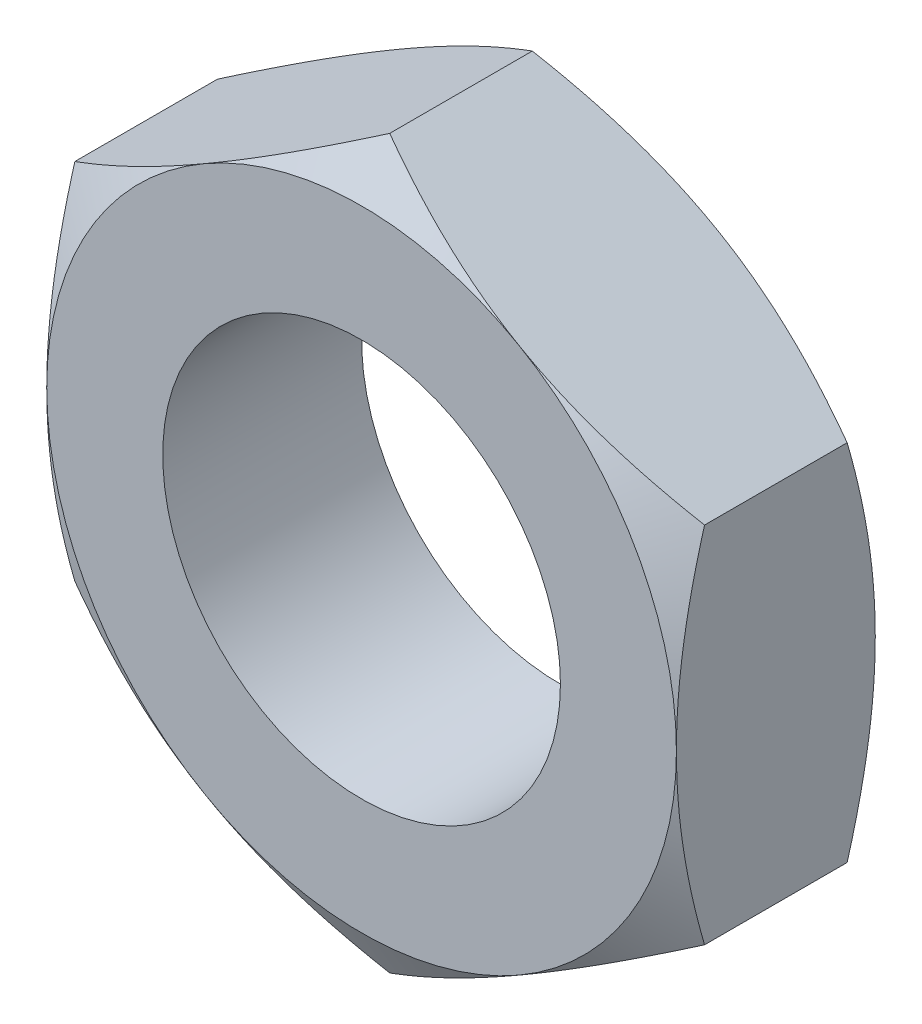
ISO-10303-21;
HEADER;
FILE_DESCRIPTION(('STEP AP214'),'2;1');
FILE_NAME('part.step','',(''),(''),'','','');
FILE_SCHEMA(('AUTOMOTIVE_DESIGN { 1 0 10303 214 1 1 1 1 }'));
ENDSEC;
DATA;
#1=APPLICATION_CONTEXT('core data for automotive mechanical design processes');
#2=APPLICATION_PROTOCOL_DEFINITION('international standard','automotive_design',2000,#1);
#3=PRODUCT_CONTEXT('',#1,'mechanical');
#4=PRODUCT('Part','Part','',(#3));
#5=PRODUCT_RELATED_PRODUCT_CATEGORY('part','',(#4));
#6=PRODUCT_DEFINITION_FORMATION('','',#4);
#7=PRODUCT_DEFINITION_CONTEXT('part definition',#1,'design');
#8=PRODUCT_DEFINITION('design','',#6,#7);
#9=PRODUCT_DEFINITION_SHAPE('','',#8);
#10=(LENGTH_UNIT() NAMED_UNIT(*) SI_UNIT(.MILLI.,.METRE.));
#11=(NAMED_UNIT(*) PLANE_ANGLE_UNIT() SI_UNIT($,.RADIAN.));
#12=(NAMED_UNIT(*) SI_UNIT($,.STERADIAN.) SOLID_ANGLE_UNIT());
#13=UNCERTAINTY_MEASURE_WITH_UNIT(LENGTH_MEASURE(1.E-05),#10,'distance_accuracy_value','');
#14=(GEOMETRIC_REPRESENTATION_CONTEXT(3) GLOBAL_UNCERTAINTY_ASSIGNED_CONTEXT((#13)) GLOBAL_UNIT_ASSIGNED_CONTEXT((#10,
#11,#12)) REPRESENTATION_CONTEXT('',''));
#15=CARTESIAN_POINT('',(0.,0.,0.));
#16=DIRECTION('',(0.,0.,1.));
#17=DIRECTION('',(1.,0.,0.));
#18=AXIS2_PLACEMENT_3D('',#15,#16,#17);
#19=CARTESIAN_POINT('',(-9.5,16.4544826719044,6.));
#20=DIRECTION('',(0.,0.,1.));
#21=DIRECTION('',(1.,0.,0.));
#22=AXIS2_PLACEMENT_3D('',#19,#20,#21);
#23=PLANE('',#22);
#24=CARTESIAN_POINT('',(0.,0.,6.));
#25=DIRECTION('',(0.,0.,-1.));
#26=DIRECTION('',(-1.,0.,0.));
#27=AXIS2_PLACEMENT_3D('',#24,#25,#26);
#28=CIRCLE('',#27,9.5);
#29=CARTESIAN_POINT('',(9.5,0.,6.));
#30=VERTEX_POINT('',#29);
#31=CARTESIAN_POINT('',(4.75,-8.22724133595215,6.));
#32=VERTEX_POINT('',#31);
#33=EDGE_CURVE('E121',#30,#32,#28,.T.);
#34=ORIENTED_EDGE('',*,*,#33,.F.);
#35=CARTESIAN_POINT('',(4.75,8.22724133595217,6.));
#36=VERTEX_POINT('',#35);
#37=EDGE_CURVE('E111',#36,#30,#28,.T.);
#38=ORIENTED_EDGE('',*,*,#37,.F.);
#39=CARTESIAN_POINT('',(-4.75,8.22724133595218,6.));
#40=VERTEX_POINT('',#39);
#41=EDGE_CURVE('E120',#40,#36,#28,.T.);
#42=ORIENTED_EDGE('',*,*,#41,.F.);
#43=CARTESIAN_POINT('',(-9.5,0.,6.));
#44=VERTEX_POINT('',#43);
#45=EDGE_CURVE('E36',#44,#40,#28,.T.);
#46=ORIENTED_EDGE('',*,*,#45,.F.);
#47=CARTESIAN_POINT('',(-4.75,-8.22724133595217,6.));
#48=VERTEX_POINT('',#47);
#49=EDGE_CURVE('E44',#48,#44,#28,.T.);
#50=ORIENTED_EDGE('',*,*,#49,.F.);
#51=EDGE_CURVE('E138',#32,#48,#28,.T.);
#52=ORIENTED_EDGE('',*,*,#51,.F.);
#53=EDGE_LOOP('',(#34,#38,#42,#46,#50,#52));
#54=FACE_BOUND('',#53,.T.);
#55=CARTESIAN_POINT('',(0.,0.,6.));
#56=DIRECTION('',(0.,0.,1.));
#57=DIRECTION('',(1.,0.,0.));
#58=AXIS2_PLACEMENT_3D('',#55,#56,#57);
#59=CIRCLE('',#58,6.);
#60=CARTESIAN_POINT('',(6.,0.,6.));
#61=VERTEX_POINT('',#60);
#62=EDGE_CURVE('E222',#61,#61,#59,.T.);
#63=ORIENTED_EDGE('',*,*,#62,.F.);
#64=EDGE_LOOP('',(#63));
#65=FACE_BOUND('',#64,.T.);
#66=ADVANCED_FACE('F14',(#54,#65),#23,.T.);
#67=CARTESIAN_POINT('',(-9.5,16.4544826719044,0.));
#68=DIRECTION('',(0.,0.,1.));
#69=DIRECTION('',(1.,0.,0.));
#70=AXIS2_PLACEMENT_3D('',#67,#68,#69);
#71=PLANE('',#70);
#72=CARTESIAN_POINT('',(0.,0.,0.));
#73=DIRECTION('',(0.,0.,-1.));
#74=DIRECTION('',(-1.,0.,0.));
#75=AXIS2_PLACEMENT_3D('',#72,#73,#74);
#76=CIRCLE('',#75,9.5);
#77=CARTESIAN_POINT('',(4.75,8.22724133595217,0.));
#78=VERTEX_POINT('',#77);
#79=CARTESIAN_POINT('',(9.5,0.,0.));
#80=VERTEX_POINT('',#79);
#81=EDGE_CURVE('E294',#78,#80,#76,.T.);
#82=ORIENTED_EDGE('',*,*,#81,.T.);
#83=CARTESIAN_POINT('',(4.75,-8.22724133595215,0.));
#84=VERTEX_POINT('',#83);
#85=EDGE_CURVE('E309',#80,#84,#76,.T.);
#86=ORIENTED_EDGE('',*,*,#85,.T.);
#87=CARTESIAN_POINT('',(-4.75,-8.22724133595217,0.));
#88=VERTEX_POINT('',#87);
#89=EDGE_CURVE('E307',#84,#88,#76,.T.);
#90=ORIENTED_EDGE('',*,*,#89,.T.);
#91=CARTESIAN_POINT('',(-9.5,0.,0.));
#92=VERTEX_POINT('',#91);
#93=EDGE_CURVE('E302',#88,#92,#76,.T.);
#94=ORIENTED_EDGE('',*,*,#93,.T.);
#95=CARTESIAN_POINT('',(-4.75,8.22724133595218,0.));
#96=VERTEX_POINT('',#95);
#97=EDGE_CURVE('E293',#92,#96,#76,.T.);
#98=ORIENTED_EDGE('',*,*,#97,.T.);
#99=EDGE_CURVE('E287',#96,#78,#76,.T.);
#100=ORIENTED_EDGE('',*,*,#99,.T.);
#101=EDGE_LOOP('',(#82,#86,#90,#94,#98,#100));
#102=FACE_BOUND('',#101,.T.);
#103=CARTESIAN_POINT('',(0.,0.,0.));
#104=DIRECTION('',(0.,0.,1.));
#105=DIRECTION('',(1.,0.,0.));
#106=AXIS2_PLACEMENT_3D('',#103,#104,#105);
#107=CIRCLE('',#106,6.);
#108=CARTESIAN_POINT('',(6.,0.,0.));
#109=VERTEX_POINT('',#108);
#110=EDGE_CURVE('E225',#109,#109,#107,.T.);
#111=ORIENTED_EDGE('',*,*,#110,.T.);
#112=EDGE_LOOP('',(#111));
#113=FACE_BOUND('',#112,.T.);
#114=ADVANCED_FACE('F247',(#102,#113),#71,.F.);
#115=CARTESIAN_POINT('',(9.5,5.48482755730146,6.));
#116=DIRECTION('',(-0.5,-0.866025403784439,0.));
#117=DIRECTION('',(0.866025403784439,-0.5,0.));
#118=AXIS2_PLACEMENT_3D('',#115,#116,#117);
#119=PLANE('',#118);
#120=DIRECTION('',(0.,0.,-1.));
#121=VECTOR('',#120,1.);
#122=CARTESIAN_POINT('',(0.,10.9696551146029,6.));
#123=LINE('',#122,#121);
#124=CARTESIAN_POINT('',(0.,10.9696551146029,5.1514942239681));
#125=VERTEX_POINT('',#124);
#126=CARTESIAN_POINT('',(0.,10.9696551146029,0.848505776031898));
#127=VERTEX_POINT('',#126);
#128=EDGE_CURVE('E237',#125,#127,#123,.T.);
#129=ORIENTED_EDGE('',*,*,#128,.F.);
#130=CARTESIAN_POINT('',(-0.000200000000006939,10.9697705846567,5.15142755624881));
#131=CARTESIAN_POINT('',(0.208630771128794,10.8492020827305,5.22102656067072));
#132=CARTESIAN_POINT('',(0.418240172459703,10.7281840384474,5.28746669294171));
#133=CARTESIAN_POINT('',(0.839139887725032,10.4851774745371,5.41315271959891));
#134=CARTESIAN_POINT('',(1.05043073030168,10.3631886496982,5.47239624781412));
#135=CARTESIAN_POINT('',(1.68770779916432,9.99525656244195,5.63818542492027));
#136=CARTESIAN_POINT('',(2.11620976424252,9.74786083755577,5.7324855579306));
#137=CARTESIAN_POINT('',(2.75744333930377,9.37764446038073,5.84306129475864));
#138=CARTESIAN_POINT('',(2.96825921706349,9.25592985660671,5.87456017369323));
#139=CARTESIAN_POINT('',(3.39086703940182,9.01193711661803,5.92738179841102));
#140=CARTESIAN_POINT('',(3.60265900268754,8.88965896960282,5.94870434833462));
#141=CARTESIAN_POINT('',(4.0265962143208,8.64489870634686,5.98062697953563));
#142=CARTESIAN_POINT('',(4.23874074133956,8.52241700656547,5.99123980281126));
#143=CARTESIAN_POINT('',(4.66322575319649,8.27734047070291,6.00151746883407));
#144=CARTESIAN_POINT('',(4.87556623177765,8.15474563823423,6.00118264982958));
#145=CARTESIAN_POINT('',(5.27254199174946,7.92555157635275,5.99032663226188));
#146=CARTESIAN_POINT('',(5.45720529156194,7.81893617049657,5.98112973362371));
#147=CARTESIAN_POINT('',(5.82610000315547,7.60595470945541,5.95463460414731));
#148=CARTESIAN_POINT('',(6.01033138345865,7.4995886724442,5.93733580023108));
#149=CARTESIAN_POINT('',(6.56231167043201,7.18090270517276,5.87369551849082));
#150=CARTESIAN_POINT('',(6.92908353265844,6.96914687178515,5.81561809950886));
#151=CARTESIAN_POINT('',(7.66651782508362,6.54338898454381,5.67042398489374));
#152=CARTESIAN_POINT('',(8.03708614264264,6.32944126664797,5.58269183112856));
#153=CARTESIAN_POINT('',(8.77269671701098,5.90473630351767,5.38357626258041));
#154=CARTESIAN_POINT('',(9.137748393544,5.6939736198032,5.27223961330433));
#155=CARTESIAN_POINT('',(9.5002,5.48471208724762,5.15142755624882));
#156=B_SPLINE_CURVE_WITH_KNOTS('',3,(#130,#131,#132,#133,#134,#135,#136,#137,#138,#139,#140,
#141,#142,#143,#144,#145,#146,#147,#148,#149,#150,#151,#152,#153,#154,#155),.UNSPECIFIED.,.F.,
.F.,(4,2,2,2,2,2,2,2,2,2,2,2,4),(0.,0.752880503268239,1.50600787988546,3.01546870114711,
3.75167336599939,4.48789219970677,5.22323407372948,5.95855322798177,6.59868084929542,
7.23885375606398,8.52010929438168,9.82978009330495,11.1368800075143),.UNSPECIFIED.);
#157=EDGE_CURVE('E321',#125,#36,#156,.T.);
#158=ORIENTED_EDGE('',*,*,#157,.T.);
#159=CARTESIAN_POINT('',(9.5,5.48482755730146,5.15149422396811));
#160=VERTEX_POINT('',#159);
#161=EDGE_CURVE('E115',#36,#160,#156,.T.);
#162=ORIENTED_EDGE('',*,*,#161,.T.);
#163=DIRECTION('',(0.,0.,-1.));
#164=VECTOR('',#163,1.);
#165=CARTESIAN_POINT('',(9.5,5.48482755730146,6.));
#166=LINE('',#165,#164);
#167=CARTESIAN_POINT('',(9.5,5.48482755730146,0.84850577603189));
#168=VERTEX_POINT('',#167);
#169=EDGE_CURVE('E135',#160,#168,#166,.T.);
#170=ORIENTED_EDGE('',*,*,#169,.T.);
#171=CARTESIAN_POINT('',(9.5002,5.48471208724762,0.848572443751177));
#172=CARTESIAN_POINT('',(9.2913692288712,5.60528058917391,0.77897343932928));
#173=CARTESIAN_POINT('',(9.08175982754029,5.72629863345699,0.712533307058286));
#174=CARTESIAN_POINT('',(8.66086011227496,5.96930519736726,0.586847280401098));
#175=CARTESIAN_POINT('',(8.44956926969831,6.09129402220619,0.527603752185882));
#176=CARTESIAN_POINT('',(7.81229220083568,6.45922610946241,0.361814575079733));
#177=CARTESIAN_POINT('',(7.38379023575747,6.7066218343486,0.267514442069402));
#178=CARTESIAN_POINT('',(6.74255666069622,7.07683821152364,0.156938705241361));
#179=CARTESIAN_POINT('',(6.5317407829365,7.19855281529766,0.125439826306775));
#180=CARTESIAN_POINT('',(6.10913296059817,7.44254555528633,0.0726182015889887));
#181=CARTESIAN_POINT('',(5.89734099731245,7.56482370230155,0.0512956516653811));
#182=CARTESIAN_POINT('',(5.4734037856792,7.8095839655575,0.0193730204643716));
#183=CARTESIAN_POINT('',(5.26125925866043,7.9320656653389,0.00876019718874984));
#184=CARTESIAN_POINT('',(4.8367742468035,8.17714220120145,-0.00151746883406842));
#185=CARTESIAN_POINT('',(4.62443376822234,8.29973703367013,-0.00118264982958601));
#186=CARTESIAN_POINT('',(4.22745800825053,8.52893109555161,0.00967336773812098));
#187=CARTESIAN_POINT('',(4.04279470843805,8.6355465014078,0.0188702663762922));
#188=CARTESIAN_POINT('',(3.67389999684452,8.84852796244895,0.0453653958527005));
#189=CARTESIAN_POINT('',(3.48966861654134,8.95489399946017,0.0626641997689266));
#190=CARTESIAN_POINT('',(2.93768832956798,9.2735799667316,0.126304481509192));
#191=CARTESIAN_POINT('',(2.57091646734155,9.48533580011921,0.184381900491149));
#192=CARTESIAN_POINT('',(1.83348217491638,9.91109368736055,0.329576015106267));
#193=CARTESIAN_POINT('',(1.46291385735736,10.1250414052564,0.417308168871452));
#194=CARTESIAN_POINT('',(0.727303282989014,10.5497463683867,0.616423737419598));
#195=CARTESIAN_POINT('',(0.362251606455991,10.7605090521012,0.727760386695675));
#196=CARTESIAN_POINT('',(-0.000200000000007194,10.9697705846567,0.848572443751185));
#197=B_SPLINE_CURVE_WITH_KNOTS('',3,(#171,#172,#173,#174,#175,#176,#177,#178,#179,#180,#181,
#182,#183,#184,#185,#186,#187,#188,#189,#190,#191,#192,#193,#194,#195,#196),.UNSPECIFIED.,.F.,
.F.,(4,2,2,2,2,2,2,2,2,2,2,2,4),(0.,0.752880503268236,1.50600787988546,3.01546870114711,
3.75167336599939,4.48789219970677,5.22323407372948,5.95855322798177,6.59868084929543,
7.23885375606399,8.52010929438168,9.82978009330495,11.1368800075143),.UNSPECIFIED.);
#198=EDGE_CURVE('E221',#168,#78,#197,.T.);
#199=ORIENTED_EDGE('',*,*,#198,.T.);
#200=EDGE_CURVE('E214',#78,#127,#197,.T.);
#201=ORIENTED_EDGE('',*,*,#200,.T.);
#202=EDGE_LOOP('',(#129,#158,#162,#170,#199,#201));
#203=FACE_BOUND('',#202,.T.);
#204=ADVANCED_FACE('F16',(#203),#119,.F.);
#205=CARTESIAN_POINT('',(0.,10.9696551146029,6.));
#206=DIRECTION('',(0.5,-0.866025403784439,0.));
#207=DIRECTION('',(0.866025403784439,0.5,0.));
#208=AXIS2_PLACEMENT_3D('',#205,#206,#207);
#209=PLANE('',#208);
#210=DIRECTION('',(0.,0.,-1.));
#211=VECTOR('',#210,1.);
#212=CARTESIAN_POINT('',(-9.5,5.48482755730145,6.));
#213=LINE('',#212,#211);
#214=CARTESIAN_POINT('',(-9.5,5.48482755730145,5.1514942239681));
#215=VERTEX_POINT('',#214);
#216=CARTESIAN_POINT('',(-9.5,5.48482755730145,0.848505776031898));
#217=VERTEX_POINT('',#216);
#218=EDGE_CURVE('E235',#215,#217,#213,.T.);
#219=ORIENTED_EDGE('',*,*,#218,.F.);
#220=CARTESIAN_POINT('',(-9.5002,5.48471208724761,5.15142755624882));
#221=CARTESIAN_POINT('',(-9.2913692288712,5.60528058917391,5.22102656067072));
#222=CARTESIAN_POINT('',(-9.0817598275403,5.72629863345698,5.28746669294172));
#223=CARTESIAN_POINT('',(-8.66086011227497,5.96930519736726,5.41315271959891));
#224=CARTESIAN_POINT('',(-8.44956926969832,6.09129402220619,5.47239624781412));
#225=CARTESIAN_POINT('',(-7.81229220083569,6.45922610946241,5.63818542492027));
#226=CARTESIAN_POINT('',(-7.38379023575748,6.70662183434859,5.7324855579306));
#227=CARTESIAN_POINT('',(-6.74255666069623,7.07683821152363,5.84306129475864));
#228=CARTESIAN_POINT('',(-6.53174078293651,7.19855281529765,5.87456017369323));
#229=CARTESIAN_POINT('',(-6.10913296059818,7.44254555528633,5.92738179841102));
#230=CARTESIAN_POINT('',(-5.89734099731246,7.56482370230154,5.94870434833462));
#231=CARTESIAN_POINT('',(-5.47340378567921,7.8095839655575,5.98062697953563));
#232=CARTESIAN_POINT('',(-5.26125925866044,7.93206566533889,5.99123980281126));
#233=CARTESIAN_POINT('',(-4.83677424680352,8.17714220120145,6.00151746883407));
#234=CARTESIAN_POINT('',(-4.62443376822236,8.29973703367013,6.00118264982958));
#235=CARTESIAN_POINT('',(-4.22745800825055,8.52893109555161,5.99032663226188));
#236=CARTESIAN_POINT('',(-4.04279470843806,8.6355465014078,5.98112973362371));
#237=CARTESIAN_POINT('',(-3.67389999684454,8.84852796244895,5.95463460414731));
#238=CARTESIAN_POINT('',(-3.48966861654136,8.95489399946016,5.93733580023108));
#239=CARTESIAN_POINT('',(-2.937688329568,9.2735799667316,5.87369551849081));
#240=CARTESIAN_POINT('',(-2.57091646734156,9.48533580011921,5.81561809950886));
#241=CARTESIAN_POINT('',(-1.83348217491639,9.91109368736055,5.67042398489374));
#242=CARTESIAN_POINT('',(-1.46291385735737,10.1250414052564,5.58269183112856));
#243=CARTESIAN_POINT('',(-0.727303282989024,10.5497463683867,5.38357626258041));
#244=CARTESIAN_POINT('',(-0.362251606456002,10.7605090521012,5.27223961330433));
#245=CARTESIAN_POINT('',(0.000199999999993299,10.9697705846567,5.15142755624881));
#246=B_SPLINE_CURVE_WITH_KNOTS('',3,(#220,#221,#222,#223,#224,#225,#226,#227,#228,#229,#230,
#231,#232,#233,#234,#235,#236,#237,#238,#239,#240,#241,#242,#243,#244,#245),.UNSPECIFIED.,.F.,
.F.,(4,2,2,2,2,2,2,2,2,2,2,2,4),(0.,0.752880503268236,1.50600787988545,3.0154687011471,
3.75167336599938,4.48789219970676,5.22323407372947,5.95855322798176,6.59868084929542,
7.23885375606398,8.52010929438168,9.82978009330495,11.1368800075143),.UNSPECIFIED.);
#247=EDGE_CURVE('E182',#215,#40,#246,.T.);
#248=ORIENTED_EDGE('',*,*,#247,.T.);
#249=EDGE_CURVE('E176',#40,#125,#246,.T.);
#250=ORIENTED_EDGE('',*,*,#249,.T.);
#251=ORIENTED_EDGE('',*,*,#128,.T.);
#252=CARTESIAN_POINT('',(0.000199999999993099,10.9697705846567,0.848572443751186));
#253=CARTESIAN_POINT('',(-0.208630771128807,10.8492020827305,0.778973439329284));
#254=CARTESIAN_POINT('',(-0.418240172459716,10.7281840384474,0.712533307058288));
#255=CARTESIAN_POINT('',(-0.839139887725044,10.4851774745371,0.586847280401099));
#256=CARTESIAN_POINT('',(-1.05043073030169,10.3631886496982,0.527603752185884));
#257=CARTESIAN_POINT('',(-1.68770779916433,9.99525656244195,0.361814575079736));
#258=CARTESIAN_POINT('',(-2.11620976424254,9.74786083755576,0.267514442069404));
#259=CARTESIAN_POINT('',(-2.75744333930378,9.37764446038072,0.156938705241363));
#260=CARTESIAN_POINT('',(-2.9682592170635,9.25592985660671,0.125439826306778));
#261=CARTESIAN_POINT('',(-3.39086703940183,9.01193711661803,0.0726182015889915));
#262=CARTESIAN_POINT('',(-3.60265900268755,8.88965896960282,0.0512956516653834));
#263=CARTESIAN_POINT('',(-4.0265962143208,8.64489870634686,0.0193730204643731));
#264=CARTESIAN_POINT('',(-4.23874074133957,8.52241700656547,0.00876019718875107));
#265=CARTESIAN_POINT('',(-4.6632257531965,8.27734047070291,-0.00151746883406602));
#266=CARTESIAN_POINT('',(-4.87556623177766,8.15474563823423,-0.00118264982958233));
#267=CARTESIAN_POINT('',(-5.27254199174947,7.92555157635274,0.00967336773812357));
#268=CARTESIAN_POINT('',(-5.45720529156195,7.81893617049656,0.018870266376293));
#269=CARTESIAN_POINT('',(-5.82610000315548,7.60595470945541,0.0453653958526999));
#270=CARTESIAN_POINT('',(-6.01033138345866,7.49958867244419,0.0626641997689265));
#271=CARTESIAN_POINT('',(-6.56231167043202,7.18090270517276,0.126304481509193));
#272=CARTESIAN_POINT('',(-6.92908353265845,6.96914687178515,0.184381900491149));
#273=CARTESIAN_POINT('',(-7.66651782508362,6.54338898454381,0.329576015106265));
#274=CARTESIAN_POINT('',(-8.03708614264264,6.32944126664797,0.41730816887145));
#275=CARTESIAN_POINT('',(-8.77269671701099,5.90473630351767,0.616423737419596));
#276=CARTESIAN_POINT('',(-9.13774839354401,5.6939736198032,0.727760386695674));
#277=CARTESIAN_POINT('',(-9.5002,5.48471208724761,0.848572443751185));
#278=B_SPLINE_CURVE_WITH_KNOTS('',3,(#252,#253,#254,#255,#256,#257,#258,#259,#260,#261,#262,
#263,#264,#265,#266,#267,#268,#269,#270,#271,#272,#273,#274,#275,#276,#277),.UNSPECIFIED.,.F.,
.F.,(4,2,2,2,2,2,2,2,2,2,2,2,4),(0.,0.752880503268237,1.50600787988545,3.01546870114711,
3.75167336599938,4.48789219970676,5.22323407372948,5.95855322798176,6.59868084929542,
7.23885375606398,8.52010929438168,9.82978009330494,11.1368800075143),.UNSPECIFIED.);
#279=EDGE_CURVE('E206',#127,#96,#278,.T.);
#280=ORIENTED_EDGE('',*,*,#279,.T.);
#281=EDGE_CURVE('E198',#96,#217,#278,.T.);
#282=ORIENTED_EDGE('',*,*,#281,.T.);
#283=EDGE_LOOP('',(#219,#248,#250,#251,#280,#282));
#284=FACE_BOUND('',#283,.T.);
#285=ADVANCED_FACE('F190',(#284),#209,.F.);
#286=CARTESIAN_POINT('',(-9.5,5.48482755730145,6.));
#287=DIRECTION('',(1.,0.,0.));
#288=DIRECTION('',(0.,1.,0.));
#289=AXIS2_PLACEMENT_3D('',#286,#287,#288);
#290=PLANE('',#289);
#291=DIRECTION('',(0.,0.,-1.));
#292=VECTOR('',#291,1.);
#293=CARTESIAN_POINT('',(-9.5,-5.48482755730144,6.));
#294=LINE('',#293,#292);
#295=CARTESIAN_POINT('',(-9.5,-5.48482755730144,5.1514942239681));
#296=VERTEX_POINT('',#295);
#297=CARTESIAN_POINT('',(-9.5,-5.48482755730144,0.848505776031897));
#298=VERTEX_POINT('',#297);
#299=EDGE_CURVE('E233',#296,#298,#294,.T.);
#300=ORIENTED_EDGE('',*,*,#299,.F.);
#301=CARTESIAN_POINT('',(-9.5,-14.6458232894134,1.40596948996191));
#302=CARTESIAN_POINT('',(-9.50000000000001,-14.4387307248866,1.50627781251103));
#303=CARTESIAN_POINT('',(-9.50000000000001,-14.2313927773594,1.60607929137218));
#304=CARTESIAN_POINT('',(-9.50000000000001,-13.8161748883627,1.8045535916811));
#305=CARTESIAN_POINT('',(-9.50000000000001,-13.6082949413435,1.90322640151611));
#306=CARTESIAN_POINT('',(-9.5,-12.9837086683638,2.19740595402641));
#307=CARTESIAN_POINT('',(-9.50000000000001,-12.5661185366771,2.39104340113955));
#308=CARTESIAN_POINT('',(-9.50000000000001,-11.7257997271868,2.77320719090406));
#309=CARTESIAN_POINT('',(-9.50000000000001,-11.3030553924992,2.96169919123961));
#310=CARTESIAN_POINT('',(-9.50000000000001,-10.4541744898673,3.33085533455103));
#311=CARTESIAN_POINT('',(-9.50000000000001,-10.0280380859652,3.51151985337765));
#312=CARTESIAN_POINT('',(-9.50000000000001,-9.15826900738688,3.86845612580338));
#313=CARTESIAN_POINT('',(-9.50000000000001,-8.71450639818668,4.04441301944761));
#314=CARTESIAN_POINT('',(-9.50000000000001,-7.82175847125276,4.38279782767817));
#315=CARTESIAN_POINT('',(-9.5,-7.37277256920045,4.54522421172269));
#316=CARTESIAN_POINT('',(-9.5,-6.4697272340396,4.85221909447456));
#317=CARTESIAN_POINT('',(-9.50000000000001,-6.01568049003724,4.99682451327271));
#318=CARTESIAN_POINT('',(-9.5,-5.10109144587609,5.26348209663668));
#319=CARTESIAN_POINT('',(-9.5,-4.64055126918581,5.38554145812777));
#320=CARTESIAN_POINT('',(-9.5,-3.71518167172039,5.60053791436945));
#321=CARTESIAN_POINT('',(-9.5,-3.2503892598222,5.69362996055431));
#322=CARTESIAN_POINT('',(-9.5,-2.54903862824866,5.80747036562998));
#323=CARTESIAN_POINT('',(-9.5,-2.31454348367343,5.84111912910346));
#324=CARTESIAN_POINT('',(-9.5,-1.84441748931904,5.89915552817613));
#325=CARTESIAN_POINT('',(-9.5,-1.60878675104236,5.92354405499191));
#326=CARTESIAN_POINT('',(-9.5,-1.13974453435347,5.96227274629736));
#327=CARTESIAN_POINT('',(-9.5,-0.906343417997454,5.97673793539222));
#328=CARTESIAN_POINT('',(-9.5,-0.439138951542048,5.99579145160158));
#329=CARTESIAN_POINT('',(-9.5,-0.205335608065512,6.00037993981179));
#330=CARTESIAN_POINT('',(-9.5,0.262256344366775,5.99957083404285));
#331=CARTESIAN_POINT('',(-9.5,0.496044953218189,5.99417317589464));
#332=CARTESIAN_POINT('',(-9.5,0.963189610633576,5.97352202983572));
#333=CARTESIAN_POINT('',(-9.5,1.1965456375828,5.95826806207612));
#334=CARTESIAN_POINT('',(-9.5,1.76004979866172,5.90985252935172));
#335=CARTESIAN_POINT('',(-9.5,2.08979045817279,5.87186593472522));
#336=CARTESIAN_POINT('',(-9.5,2.74676859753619,5.77830298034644));
#337=CARTESIAN_POINT('',(-9.5,3.07400571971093,5.72272415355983));
#338=CARTESIAN_POINT('',(-9.5,3.72568449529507,5.59595407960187));
#339=CARTESIAN_POINT('',(-9.5,4.05012370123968,5.52475037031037));
#340=CARTESIAN_POINT('',(-9.5,4.69572034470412,5.3688983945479));
#341=CARTESIAN_POINT('',(-9.5,5.01687783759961,5.28425035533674));
#342=CARTESIAN_POINT('',(-9.5,5.66289592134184,5.10158538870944));
#343=CARTESIAN_POINT('',(-9.5,5.98768512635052,5.00331773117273));
#344=CARTESIAN_POINT('',(-9.5,6.63406328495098,4.79682039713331));
#345=CARTESIAN_POINT('',(-9.5,6.95565221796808,4.6885906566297));
#346=CARTESIAN_POINT('',(-9.5,7.59579186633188,4.46387076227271));
#347=CARTESIAN_POINT('',(-9.5,7.91434359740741,4.34738348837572));
#348=CARTESIAN_POINT('',(-9.5,8.54882058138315,4.10750012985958));
#349=CARTESIAN_POINT('',(-9.5,8.8647458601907,3.98410411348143));
#350=CARTESIAN_POINT('',(-9.5,9.5896299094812,3.6932954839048));
#351=CARTESIAN_POINT('',(-9.5,9.99778069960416,3.52387231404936));
#352=CARTESIAN_POINT('',(-9.5,10.8107741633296,3.17724511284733));
#353=CARTESIAN_POINT('',(-9.5,11.2156166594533,3.00004066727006));
#354=CARTESIAN_POINT('',(-9.5,12.0225826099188,2.63935280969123));
#355=CARTESIAN_POINT('',(-9.5,12.4247055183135,2.45586817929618));
#356=CARTESIAN_POINT('',(-9.5,13.2265894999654,2.08383905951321));
#357=CARTESIAN_POINT('',(-9.5,13.6263506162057,1.89529466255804));
#358=CARTESIAN_POINT('',(-9.5,14.4242833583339,1.51387250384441));
#359=CARTESIAN_POINT('',(-9.5,14.822453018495,1.32099063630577));
#360=CARTESIAN_POINT('',(-9.5,15.6171093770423,0.931787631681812));
#361=CARTESIAN_POINT('',(-9.5,16.013596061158,0.73546646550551));
#362=CARTESIAN_POINT('',(-9.5,17.20082699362,0.142275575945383));
#363=CARTESIAN_POINT('',(-9.5,17.9894362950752,-0.258866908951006));
#364=CARTESIAN_POINT('',(-9.5,19.4998796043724,-1.03700840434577));
#365=CARTESIAN_POINT('',(-9.49999999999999,20.2220337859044,-1.41338862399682));
#366=CARTESIAN_POINT('',(-9.49999999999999,21.663629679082,-2.17135830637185));
#367=CARTESIAN_POINT('',(-9.49999999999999,22.3830713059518,-2.55294793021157));
#368=CARTESIAN_POINT('',(-9.49999999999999,23.818175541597,-3.31923699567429));
#369=CARTESIAN_POINT('',(-9.49999999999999,24.533843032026,-3.70392730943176));
#370=CARTESIAN_POINT('',(-9.49999999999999,25.9634306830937,-4.47645584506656));
#371=CARTESIAN_POINT('',(-9.49999999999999,26.6773509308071,-4.86429390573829));
#372=CARTESIAN_POINT('',(-9.5,27.3906219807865,-5.25331424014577));
#373=B_SPLINE_CURVE_WITH_KNOTS('',3,(#301,#302,#303,#304,#305,#306,#307,#308,#309,#310,#311,
#312,#313,#314,#315,#316,#317,#318,#319,#320,#321,#322,#323,#324,#325,#326,#327,#328,#329,#330,
#331,#332,#333,#334,#335,#336,#337,#338,#339,#340,#341,#342,#343,#344,#345,#346,#347,#348,#349,
#350,#351,#352,#353,#354,#355,#356,#357,#358,#359,#360,#361,#362,#363,#364,#365,#366,#367,#368,
#369,#370,#371,#372),.UNSPECIFIED.,.F.,.F.,(4,2,2,2,2,2,2,2,2,2,2,2,2,2,2,2,2,2,2,2,2,2,2,2,2,2,
2,2,2,2,2,2,2,2,2,4),(0.,0.690318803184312,1.38064470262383,2.7615053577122,4.15003191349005,
5.53849172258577,6.9704431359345,8.40255630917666,9.83165080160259,11.2602883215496,
12.6811469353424,13.3916839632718,14.102152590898,14.8034969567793,15.5048298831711,
16.2061673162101,16.9075388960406,17.902750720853,18.8981021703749,19.8942503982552,
20.8903817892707,21.9081791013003,22.9259829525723,23.943433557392,24.9608741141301,
26.2865199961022,27.6122365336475,28.9382117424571,30.2641627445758,31.5914266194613,
32.9187017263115,35.5729383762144,38.0159707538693,40.4590788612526,42.8965895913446,
45.3339762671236),.UNSPECIFIED.);
#374=EDGE_CURVE('E308',#296,#44,#373,.T.);
#375=ORIENTED_EDGE('',*,*,#374,.T.);
#376=EDGE_CURVE('E183',#44,#215,#373,.T.);
#377=ORIENTED_EDGE('',*,*,#376,.T.);
#378=ORIENTED_EDGE('',*,*,#218,.T.);
#379=CARTESIAN_POINT('',(-9.5,-14.6458232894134,4.59403051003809));
#380=CARTESIAN_POINT('',(-9.50000000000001,-14.4387307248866,4.49372218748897));
#381=CARTESIAN_POINT('',(-9.50000000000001,-14.2313927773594,4.39392070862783));
#382=CARTESIAN_POINT('',(-9.50000000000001,-13.8161748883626,4.1954464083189));
#383=CARTESIAN_POINT('',(-9.50000000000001,-13.6082949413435,4.0967735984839));
#384=CARTESIAN_POINT('',(-9.5,-12.9837086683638,3.80259404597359));
#385=CARTESIAN_POINT('',(-9.50000000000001,-12.5661185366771,3.60895659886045));
#386=CARTESIAN_POINT('',(-9.50000000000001,-11.7257997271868,3.22679280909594));
#387=CARTESIAN_POINT('',(-9.50000000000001,-11.3030553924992,3.0383008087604));
#388=CARTESIAN_POINT('',(-9.50000000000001,-10.4541744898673,2.66914466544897));
#389=CARTESIAN_POINT('',(-9.50000000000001,-10.0280380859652,2.48848014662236));
#390=CARTESIAN_POINT('',(-9.50000000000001,-9.15826900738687,2.13154387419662));
#391=CARTESIAN_POINT('',(-9.50000000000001,-8.71450639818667,1.95558698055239));
#392=CARTESIAN_POINT('',(-9.50000000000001,-7.82175847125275,1.61720217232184));
#393=CARTESIAN_POINT('',(-9.5,-7.37277256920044,1.45477578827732));
#394=CARTESIAN_POINT('',(-9.5,-6.4697272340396,1.14778090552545));
#395=CARTESIAN_POINT('',(-9.50000000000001,-6.01568049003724,1.00317548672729));
#396=CARTESIAN_POINT('',(-9.5,-5.10109144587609,0.736517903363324));
#397=CARTESIAN_POINT('',(-9.5,-4.64055126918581,0.614458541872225));
#398=CARTESIAN_POINT('',(-9.5,-3.71518167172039,0.399462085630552));
#399=CARTESIAN_POINT('',(-9.5,-3.2503892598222,0.306370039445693));
#400=CARTESIAN_POINT('',(-9.5,-2.54903862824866,0.192529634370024));
#401=CARTESIAN_POINT('',(-9.5,-2.31454348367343,0.158880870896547));
#402=CARTESIAN_POINT('',(-9.5,-1.84441748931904,0.10084447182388));
#403=CARTESIAN_POINT('',(-9.5,-1.60878675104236,0.0764559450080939));
#404=CARTESIAN_POINT('',(-9.5,-1.13974453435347,0.0377272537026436));
#405=CARTESIAN_POINT('',(-9.5,-0.906343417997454,0.0232620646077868));
#406=CARTESIAN_POINT('',(-9.5,-0.439138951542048,0.00420854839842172));
#407=CARTESIAN_POINT('',(-9.5,-0.205335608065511,-0.000379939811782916));
#408=CARTESIAN_POINT('',(-9.5,0.262256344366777,0.000429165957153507));
#409=CARTESIAN_POINT('',(-9.5,0.496044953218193,0.0058268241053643));
#410=CARTESIAN_POINT('',(-9.5,0.96318961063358,0.0264779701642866));
#411=CARTESIAN_POINT('',(-9.5,1.19654563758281,0.0417319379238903));
#412=CARTESIAN_POINT('',(-9.5,1.76004979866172,0.0901474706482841));
#413=CARTESIAN_POINT('',(-9.5,2.08979045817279,0.128134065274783));
#414=CARTESIAN_POINT('',(-9.5,2.7467685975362,0.221697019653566));
#415=CARTESIAN_POINT('',(-9.5,3.07400571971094,0.277275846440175));
#416=CARTESIAN_POINT('',(-9.5,3.72568449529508,0.404045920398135));
#417=CARTESIAN_POINT('',(-9.5,4.05012370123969,0.475249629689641));
#418=CARTESIAN_POINT('',(-9.5,4.69572034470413,0.631101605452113));
#419=CARTESIAN_POINT('',(-9.5,5.01687783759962,0.715749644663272));
#420=CARTESIAN_POINT('',(-9.5,5.66289592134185,0.898414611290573));
#421=CARTESIAN_POINT('',(-9.5,5.98768512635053,0.996682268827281));
#422=CARTESIAN_POINT('',(-9.5,6.63406328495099,1.20317960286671));
#423=CARTESIAN_POINT('',(-9.5,6.95565221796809,1.31140934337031));
#424=CARTESIAN_POINT('',(-9.5,7.59579186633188,1.5361292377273));
#425=CARTESIAN_POINT('',(-9.5,7.91434359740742,1.65261651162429));
#426=CARTESIAN_POINT('',(-9.5,8.54882058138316,1.89249987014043));
#427=CARTESIAN_POINT('',(-9.5,8.86474586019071,2.01589588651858));
#428=CARTESIAN_POINT('',(-9.5,9.58962990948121,2.30670451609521));
#429=CARTESIAN_POINT('',(-9.5,9.99778069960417,2.47612768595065));
#430=CARTESIAN_POINT('',(-9.5,10.8107741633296,2.82275488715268));
#431=CARTESIAN_POINT('',(-9.5,11.2156166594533,2.99995933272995));
#432=CARTESIAN_POINT('',(-9.5,12.0225826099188,3.36064719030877));
#433=CARTESIAN_POINT('',(-9.5,12.4247055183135,3.54413182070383));
#434=CARTESIAN_POINT('',(-9.5,13.2265894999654,3.9161609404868));
#435=CARTESIAN_POINT('',(-9.5,13.6263506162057,4.10470533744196));
#436=CARTESIAN_POINT('',(-9.5,14.4242833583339,4.48612749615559));
#437=CARTESIAN_POINT('',(-9.5,14.822453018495,4.67900936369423));
#438=CARTESIAN_POINT('',(-9.5,15.6171093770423,5.06821236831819));
#439=CARTESIAN_POINT('',(-9.5,16.013596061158,5.26453353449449));
#440=CARTESIAN_POINT('',(-9.5,17.2008269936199,5.85772442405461));
#441=CARTESIAN_POINT('',(-9.5,17.9894362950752,6.258866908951));
#442=CARTESIAN_POINT('',(-9.5,19.4998796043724,7.03700840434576));
#443=CARTESIAN_POINT('',(-9.49999999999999,20.2220337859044,7.41338862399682));
#444=CARTESIAN_POINT('',(-9.49999999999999,21.663629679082,8.17135830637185));
#445=CARTESIAN_POINT('',(-9.49999999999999,22.3830713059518,8.55294793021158));
#446=CARTESIAN_POINT('',(-9.49999999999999,23.818175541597,9.31923699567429));
#447=CARTESIAN_POINT('',(-9.49999999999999,24.5338430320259,9.70392730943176));
#448=CARTESIAN_POINT('',(-9.49999999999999,25.9634306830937,10.4764558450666));
#449=CARTESIAN_POINT('',(-9.49999999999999,26.6773509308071,10.8642939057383));
#450=CARTESIAN_POINT('',(-9.5,27.3906219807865,11.2533142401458));
#451=B_SPLINE_CURVE_WITH_KNOTS('',3,(#379,#380,#381,#382,#383,#384,#385,#386,#387,#388,#389,
#390,#391,#392,#393,#394,#395,#396,#397,#398,#399,#400,#401,#402,#403,#404,#405,#406,#407,#408,
#409,#410,#411,#412,#413,#414,#415,#416,#417,#418,#419,#420,#421,#422,#423,#424,#425,#426,#427,
#428,#429,#430,#431,#432,#433,#434,#435,#436,#437,#438,#439,#440,#441,#442,#443,#444,#445,#446,
#447,#448,#449,#450),.UNSPECIFIED.,.F.,.F.,(4,2,2,2,2,2,2,2,2,2,2,2,2,2,2,2,2,2,2,2,2,2,2,2,2,2,
2,2,2,2,2,2,2,2,2,4),(0.,0.690318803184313,1.38064470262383,2.7615053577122,4.15003191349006,
5.53849172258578,6.97044313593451,8.40255630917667,9.8316508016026,11.2602883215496,
12.6811469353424,13.3916839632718,14.102152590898,14.8034969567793,15.5048298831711,
16.2061673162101,16.9075388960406,17.902750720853,18.8981021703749,19.8942503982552,
20.8903817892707,21.9081791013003,22.9259829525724,23.943433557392,24.9608741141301,
26.2865199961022,27.6122365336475,28.9382117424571,30.2641627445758,31.5914266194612,
32.9187017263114,35.5729383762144,38.0159707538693,40.4590788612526,42.8965895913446,
45.3339762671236),.UNSPECIFIED.);
#452=EDGE_CURVE('E207',#217,#92,#451,.F.);
#453=ORIENTED_EDGE('',*,*,#452,.T.);
#454=EDGE_CURVE('E208',#92,#298,#451,.F.);
#455=ORIENTED_EDGE('',*,*,#454,.T.);
#456=EDGE_LOOP('',(#300,#375,#377,#378,#453,#455));
#457=FACE_BOUND('',#456,.T.);
#458=ADVANCED_FACE('F193',(#457),#290,.F.);
#459=CARTESIAN_POINT('',(-9.5,-5.48482755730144,6.));
#460=DIRECTION('',(0.5,0.866025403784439,0.));
#461=DIRECTION('',(-0.866025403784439,0.5,0.));
#462=AXIS2_PLACEMENT_3D('',#459,#460,#461);
#463=PLANE('',#462);
#464=DIRECTION('',(0.,0.,-1.));
#465=VECTOR('',#464,1.);
#466=CARTESIAN_POINT('',(0.,-10.9696551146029,6.));
#467=LINE('',#466,#465);
#468=CARTESIAN_POINT('',(0.,-10.9696551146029,5.15149422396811));
#469=VERTEX_POINT('',#468);
#470=CARTESIAN_POINT('',(0.,-10.9696551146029,0.848505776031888));
#471=VERTEX_POINT('',#470);
#472=EDGE_CURVE('E231',#469,#471,#467,.T.);
#473=ORIENTED_EDGE('',*,*,#472,.F.);
#474=CARTESIAN_POINT('',(0.000199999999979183,-10.9697705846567,5.15142755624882));
#475=CARTESIAN_POINT('',(-0.208630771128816,-10.8492020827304,5.22102656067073));
#476=CARTESIAN_POINT('',(-0.418240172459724,-10.7281840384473,5.28746669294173));
#477=CARTESIAN_POINT('',(-0.839139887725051,-10.4851774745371,5.41315271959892));
#478=CARTESIAN_POINT('',(-1.0504307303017,-10.3631886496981,5.47239624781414));
#479=CARTESIAN_POINT('',(-1.68770779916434,-9.99525656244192,5.63818542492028));
#480=CARTESIAN_POINT('',(-2.11620976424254,-9.74786083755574,5.73248555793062));
#481=CARTESIAN_POINT('',(-2.75744333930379,-9.3776444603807,5.84306129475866));
#482=CARTESIAN_POINT('',(-2.96825921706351,-9.25592985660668,5.87456017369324));
#483=CARTESIAN_POINT('',(-3.39086703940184,-9.011937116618,5.92738179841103));
#484=CARTESIAN_POINT('',(-3.60265900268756,-8.88965896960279,5.94870434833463));
#485=CARTESIAN_POINT('',(-4.02659621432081,-8.64489870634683,5.98062697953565));
#486=CARTESIAN_POINT('',(-4.23874074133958,-8.52241700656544,5.99123980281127));
#487=CARTESIAN_POINT('',(-4.66322575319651,-8.27734047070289,6.00151746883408));
#488=CARTESIAN_POINT('',(-4.87556623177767,-8.15474563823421,6.00118264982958));
#489=CARTESIAN_POINT('',(-5.27254199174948,-7.92555157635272,5.99032663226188));
#490=CARTESIAN_POINT('',(-5.45720529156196,-7.81893617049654,5.98112973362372));
#491=CARTESIAN_POINT('',(-5.82610000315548,-7.60595470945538,5.95463460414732));
#492=CARTESIAN_POINT('',(-6.01033138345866,-7.49958867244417,5.93733580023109));
#493=CARTESIAN_POINT('',(-6.56231167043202,-7.18090270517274,5.87369551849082));
#494=CARTESIAN_POINT('',(-6.92908353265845,-6.96914687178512,5.81561809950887));
#495=CARTESIAN_POINT('',(-7.66651782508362,-6.54338898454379,5.67042398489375));
#496=CARTESIAN_POINT('',(-8.03708614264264,-6.32944126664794,5.58269183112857));
#497=CARTESIAN_POINT('',(-8.77269671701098,-5.90473630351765,5.38357626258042));
#498=CARTESIAN_POINT('',(-9.13774839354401,-5.69397361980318,5.27223961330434));
#499=CARTESIAN_POINT('',(-9.5002,-5.4847120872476,5.15142755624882));
#500=B_SPLINE_CURVE_WITH_KNOTS('',3,(#474,#475,#476,#477,#478,#479,#480,#481,#482,#483,#484,
#485,#486,#487,#488,#489,#490,#491,#492,#493,#494,#495,#496,#497,#498,#499),.UNSPECIFIED.,.F.,
.F.,(4,2,2,2,2,2,2,2,2,2,2,2,4),(0.,0.752880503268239,1.50600787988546,3.01546870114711,
3.75167336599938,4.48789219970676,5.22323407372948,5.95855322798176,6.59868084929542,
7.23885375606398,8.52010929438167,9.82978009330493,11.1368800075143),.UNSPECIFIED.);
#501=EDGE_CURVE('E170',#469,#48,#500,.T.);
#502=ORIENTED_EDGE('',*,*,#501,.T.);
#503=EDGE_CURVE('E314',#48,#296,#500,.T.);
#504=ORIENTED_EDGE('',*,*,#503,.T.);
#505=ORIENTED_EDGE('',*,*,#299,.T.);
#506=CARTESIAN_POINT('',(-9.5002,-5.4847120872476,0.848572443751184));
#507=CARTESIAN_POINT('',(-9.2913692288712,-5.60528058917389,0.778973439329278));
#508=CARTESIAN_POINT('',(-9.08175982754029,-5.72629863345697,0.712533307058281));
#509=CARTESIAN_POINT('',(-8.66086011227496,-5.96930519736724,0.586847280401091));
#510=CARTESIAN_POINT('',(-8.44956926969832,-6.09129402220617,0.527603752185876));
#511=CARTESIAN_POINT('',(-7.81229220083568,-6.45922610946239,0.361814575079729));
#512=CARTESIAN_POINT('',(-7.38379023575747,-6.70662183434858,0.267514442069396));
#513=CARTESIAN_POINT('',(-6.74255666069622,-7.07683821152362,0.156938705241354));
#514=CARTESIAN_POINT('',(-6.53174078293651,-7.19855281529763,0.125439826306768));
#515=CARTESIAN_POINT('',(-6.10913296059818,-7.44254555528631,0.0726182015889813));
#516=CARTESIAN_POINT('',(-5.89734099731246,-7.56482370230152,0.0512956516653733));
#517=CARTESIAN_POINT('',(-5.4734037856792,-7.80958396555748,0.0193730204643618));
#518=CARTESIAN_POINT('',(-5.26125925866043,-7.93206566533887,0.00876019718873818));
#519=CARTESIAN_POINT('',(-4.83677424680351,-8.17714220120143,-0.00151746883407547));
#520=CARTESIAN_POINT('',(-4.62443376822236,-8.29973703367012,-0.00118264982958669));
#521=CARTESIAN_POINT('',(-4.22745800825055,-8.5289310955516,0.00967336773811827));
#522=CARTESIAN_POINT('',(-4.04279470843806,-8.63554650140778,0.018870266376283));
#523=CARTESIAN_POINT('',(-3.67389999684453,-8.84852796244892,0.0453653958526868));
#524=CARTESIAN_POINT('',(-3.48966861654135,-8.95489399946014,0.062664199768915));
#525=CARTESIAN_POINT('',(-2.937688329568,-9.27357996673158,0.126304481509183));
#526=CARTESIAN_POINT('',(-2.57091646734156,-9.48533580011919,0.184381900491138));
#527=CARTESIAN_POINT('',(-1.83348217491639,-9.91109368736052,0.329576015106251));
#528=CARTESIAN_POINT('',(-1.46291385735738,-10.1250414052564,0.417308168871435));
#529=CARTESIAN_POINT('',(-0.727303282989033,-10.5497463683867,0.616423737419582));
#530=CARTESIAN_POINT('',(-0.362251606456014,-10.7605090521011,0.727760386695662));
#531=CARTESIAN_POINT('',(0.000199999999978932,-10.9697705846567,0.848572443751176));
#532=B_SPLINE_CURVE_WITH_KNOTS('',3,(#506,#507,#508,#509,#510,#511,#512,#513,#514,#515,#516,
#517,#518,#519,#520,#521,#522,#523,#524,#525,#526,#527,#528,#529,#530,#531),.UNSPECIFIED.,.F.,
.F.,(4,2,2,2,2,2,2,2,2,2,2,2,4),(0.,0.752880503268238,1.50600787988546,3.01546870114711,
3.75167336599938,4.48789219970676,5.22323407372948,5.95855322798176,6.59868084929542,
7.23885375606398,8.52010929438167,9.82978009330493,11.1368800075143),.UNSPECIFIED.);
#533=EDGE_CURVE('E336',#298,#88,#532,.T.);
#534=ORIENTED_EDGE('',*,*,#533,.T.);
#535=EDGE_CURVE('E334',#88,#471,#532,.T.);
#536=ORIENTED_EDGE('',*,*,#535,.T.);
#537=EDGE_LOOP('',(#473,#502,#504,#505,#534,#536));
#538=FACE_BOUND('',#537,.T.);
#539=ADVANCED_FACE('F338',(#538),#463,.F.);
#540=CARTESIAN_POINT('',(0.,-10.9696551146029,6.));
#541=DIRECTION('',(-0.5,0.866025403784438,0.));
#542=DIRECTION('',(-0.866025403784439,-0.5,0.));
#543=AXIS2_PLACEMENT_3D('',#540,#541,#542);
#544=PLANE('',#543);
#545=DIRECTION('',(0.,0.,-1.));
#546=VECTOR('',#545,1.);
#547=CARTESIAN_POINT('',(9.5,-5.48482755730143,6.));
#548=LINE('',#547,#546);
#549=CARTESIAN_POINT('',(9.5,-5.48482755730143,5.15149422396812));
#550=VERTEX_POINT('',#549);
#551=CARTESIAN_POINT('',(9.5,-5.48482755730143,0.848505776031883));
#552=VERTEX_POINT('',#551);
#553=EDGE_CURVE('E229',#550,#552,#548,.T.);
#554=ORIENTED_EDGE('',*,*,#553,.F.);
#555=CARTESIAN_POINT('',(9.5002,-5.48471208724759,5.15142755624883));
#556=CARTESIAN_POINT('',(9.2913692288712,-5.60528058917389,5.22102656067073));
#557=CARTESIAN_POINT('',(9.0817598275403,-5.72629863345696,5.28746669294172));
#558=CARTESIAN_POINT('',(8.66086011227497,-5.96930519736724,5.41315271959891));
#559=CARTESIAN_POINT('',(8.44956926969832,-6.09129402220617,5.47239624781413));
#560=CARTESIAN_POINT('',(7.81229220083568,-6.45922610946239,5.63818542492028));
#561=CARTESIAN_POINT('',(7.38379023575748,-6.70662183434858,5.73248555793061));
#562=CARTESIAN_POINT('',(6.74255666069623,-7.07683821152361,5.84306129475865));
#563=CARTESIAN_POINT('',(6.53174078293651,-7.19855281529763,5.87456017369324));
#564=CARTESIAN_POINT('',(6.10913296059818,-7.44254555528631,5.92738179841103));
#565=CARTESIAN_POINT('',(5.89734099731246,-7.56482370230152,5.94870434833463));
#566=CARTESIAN_POINT('',(5.47340378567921,-7.80958396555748,5.98062697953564));
#567=CARTESIAN_POINT('',(5.26125925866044,-7.93206566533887,5.99123980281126));
#568=CARTESIAN_POINT('',(4.83677424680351,-8.17714220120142,6.00151746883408));
#569=CARTESIAN_POINT('',(4.62443376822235,-8.2997370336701,6.0011826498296));
#570=CARTESIAN_POINT('',(4.22745800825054,-8.52893109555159,5.9903266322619));
#571=CARTESIAN_POINT('',(4.04279470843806,-8.63554650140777,5.98112973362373));
#572=CARTESIAN_POINT('',(3.67389999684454,-8.84852796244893,5.95463460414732));
#573=CARTESIAN_POINT('',(3.48966861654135,-8.95489399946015,5.93733580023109));
#574=CARTESIAN_POINT('',(2.93768832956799,-9.27357996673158,5.87369551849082));
#575=CARTESIAN_POINT('',(2.57091646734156,-9.48533580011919,5.81561809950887));
#576=CARTESIAN_POINT('',(1.83348217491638,-9.91109368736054,5.67042398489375));
#577=CARTESIAN_POINT('',(1.46291385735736,-10.1250414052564,5.58269183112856));
#578=CARTESIAN_POINT('',(0.727303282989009,-10.5497463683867,5.38357626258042));
#579=CARTESIAN_POINT('',(0.362251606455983,-10.7605090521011,5.27223961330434));
#580=CARTESIAN_POINT('',(-0.000200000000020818,-10.9697705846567,5.15142755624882));
#581=B_SPLINE_CURVE_WITH_KNOTS('',3,(#555,#556,#557,#558,#559,#560,#561,#562,#563,#564,#565,
#566,#567,#568,#569,#570,#571,#572,#573,#574,#575,#576,#577,#578,#579,#580),.UNSPECIFIED.,.F.,
.F.,(4,2,2,2,2,2,2,2,2,2,2,2,4),(0.,0.752880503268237,1.50600787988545,3.01546870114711,
3.75167336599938,4.48789219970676,5.22323407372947,5.95855322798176,6.59868084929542,
7.23885375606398,8.52010929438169,9.82978009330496,11.1368800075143),.UNSPECIFIED.);
#582=EDGE_CURVE('E128',#550,#32,#581,.T.);
#583=ORIENTED_EDGE('',*,*,#582,.T.);
#584=EDGE_CURVE('E146',#32,#469,#581,.T.);
#585=ORIENTED_EDGE('',*,*,#584,.T.);
#586=ORIENTED_EDGE('',*,*,#472,.T.);
#587=CARTESIAN_POINT('',(-0.000200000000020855,-10.9697705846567,0.848572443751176));
#588=CARTESIAN_POINT('',(0.208630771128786,-10.8492020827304,0.778973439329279));
#589=CARTESIAN_POINT('',(0.418240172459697,-10.7281840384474,0.712533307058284));
#590=CARTESIAN_POINT('',(0.839139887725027,-10.4851774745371,0.586847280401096));
#591=CARTESIAN_POINT('',(1.05043073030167,-10.3631886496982,0.52760375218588));
#592=CARTESIAN_POINT('',(1.68770779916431,-9.99525656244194,0.36181457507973));
#593=CARTESIAN_POINT('',(2.11620976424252,-9.74786083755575,0.267514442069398));
#594=CARTESIAN_POINT('',(2.75744333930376,-9.37764446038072,0.156938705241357));
#595=CARTESIAN_POINT('',(2.96825921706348,-9.2559298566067,0.125439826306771));
#596=CARTESIAN_POINT('',(3.39086703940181,-9.01193711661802,0.0726182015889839));
#597=CARTESIAN_POINT('',(3.60265900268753,-8.88965896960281,0.051295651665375));
#598=CARTESIAN_POINT('',(4.02659621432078,-8.64489870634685,0.019373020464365));
#599=CARTESIAN_POINT('',(4.23874074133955,-8.52241700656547,0.00876019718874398));
#600=CARTESIAN_POINT('',(4.66322575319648,-8.2773404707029,-0.0015174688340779));
#601=CARTESIAN_POINT('',(4.87556623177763,-8.15474563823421,-0.00118264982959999));
#602=CARTESIAN_POINT('',(5.27254199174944,-7.92555157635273,0.00967336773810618));
#603=CARTESIAN_POINT('',(5.45720529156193,-7.81893617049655,0.0188702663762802));
#604=CARTESIAN_POINT('',(5.82610000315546,-7.60595470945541,0.045365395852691));
#605=CARTESIAN_POINT('',(6.01033138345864,-7.49958867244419,0.0626641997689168));
#606=CARTESIAN_POINT('',(6.562311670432,-7.18090270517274,0.126304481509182));
#607=CARTESIAN_POINT('',(6.92908353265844,-6.96914687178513,0.184381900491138));
#608=CARTESIAN_POINT('',(7.66651782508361,-6.5433889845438,0.329576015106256));
#609=CARTESIAN_POINT('',(8.03708614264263,-6.32944126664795,0.417308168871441));
#610=CARTESIAN_POINT('',(8.77269671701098,-5.90473630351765,0.616423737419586));
#611=CARTESIAN_POINT('',(9.137748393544,-5.69397361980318,0.727760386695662));
#612=CARTESIAN_POINT('',(9.5002,-5.48471208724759,0.848572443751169));
#613=B_SPLINE_CURVE_WITH_KNOTS('',3,(#587,#588,#589,#590,#591,#592,#593,#594,#595,#596,#597,
#598,#599,#600,#601,#602,#603,#604,#605,#606,#607,#608,#609,#610,#611,#612),.UNSPECIFIED.,.F.,
.F.,(4,2,2,2,2,2,2,2,2,2,2,2,4),(0.,0.752880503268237,1.50600787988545,3.0154687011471,
3.75167336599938,4.48789219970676,5.22323407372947,5.95855322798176,6.59868084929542,
7.23885375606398,8.52010929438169,9.82978009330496,11.1368800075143),.UNSPECIFIED.);
#614=EDGE_CURVE('E305',#471,#84,#613,.T.);
#615=ORIENTED_EDGE('',*,*,#614,.T.);
#616=EDGE_CURVE('E303',#84,#552,#613,.T.);
#617=ORIENTED_EDGE('',*,*,#616,.T.);
#618=EDGE_LOOP('',(#554,#583,#585,#586,#615,#617));
#619=FACE_BOUND('',#618,.T.);
#620=ADVANCED_FACE('F152',(#619),#544,.F.);
#621=CARTESIAN_POINT('',(9.5,-5.48482755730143,6.));
#622=DIRECTION('',(-1.,0.,0.));
#623=DIRECTION('',(0.,-1.,0.));
#624=AXIS2_PLACEMENT_3D('',#621,#622,#623);
#625=PLANE('',#624);
#626=ORIENTED_EDGE('',*,*,#169,.F.);
#627=CARTESIAN_POINT('',(9.5,-14.6458232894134,1.40596948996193));
#628=CARTESIAN_POINT('',(9.5,-14.4387307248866,1.50627781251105));
#629=CARTESIAN_POINT('',(9.5,-14.2313927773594,1.60607929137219));
#630=CARTESIAN_POINT('',(9.5,-13.8161748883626,1.80455359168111));
#631=CARTESIAN_POINT('',(9.5,-13.6082949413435,1.90322640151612));
#632=CARTESIAN_POINT('',(9.5,-12.9837086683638,2.19740595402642));
#633=CARTESIAN_POINT('',(9.5,-12.5661185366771,2.39104340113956));
#634=CARTESIAN_POINT('',(9.5,-11.7257997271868,2.77320719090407));
#635=CARTESIAN_POINT('',(9.5,-11.3030553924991,2.96169919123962));
#636=CARTESIAN_POINT('',(9.5,-10.4541744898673,3.33085533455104));
#637=CARTESIAN_POINT('',(9.5,-10.0280380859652,3.51151985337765));
#638=CARTESIAN_POINT('',(9.5,-9.15826900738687,3.86845612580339));
#639=CARTESIAN_POINT('',(9.5,-8.71450639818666,4.04441301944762));
#640=CARTESIAN_POINT('',(9.5,-7.82175847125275,4.38279782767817));
#641=CARTESIAN_POINT('',(9.5,-7.37277256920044,4.54522421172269));
#642=CARTESIAN_POINT('',(9.5,-6.46972723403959,4.85221909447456));
#643=CARTESIAN_POINT('',(9.5,-6.01568049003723,4.99682451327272));
#644=CARTESIAN_POINT('',(9.5,-5.10109144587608,5.26348209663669));
#645=CARTESIAN_POINT('',(9.5,-4.64055126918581,5.38554145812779));
#646=CARTESIAN_POINT('',(9.5,-3.71518167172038,5.60053791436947));
#647=CARTESIAN_POINT('',(9.5,-3.2503892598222,5.69362996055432));
#648=CARTESIAN_POINT('',(9.5,-2.54903862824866,5.80747036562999));
#649=CARTESIAN_POINT('',(9.5,-2.31454348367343,5.84111912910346));
#650=CARTESIAN_POINT('',(9.5,-1.84441748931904,5.89915552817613));
#651=CARTESIAN_POINT('',(9.5,-1.60878675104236,5.92354405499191));
#652=CARTESIAN_POINT('',(9.5,-1.13974453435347,5.96227274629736));
#653=CARTESIAN_POINT('',(9.5,-0.906343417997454,5.97673793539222));
#654=CARTESIAN_POINT('',(9.5,-0.439138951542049,5.99579145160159));
#655=CARTESIAN_POINT('',(9.5,-0.205335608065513,6.00037993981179));
#656=CARTESIAN_POINT('',(9.5,0.262256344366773,5.99957083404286));
#657=CARTESIAN_POINT('',(9.5,0.496044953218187,5.99417317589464));
#658=CARTESIAN_POINT('',(9.5,0.963189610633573,5.97352202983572));
#659=CARTESIAN_POINT('',(9.5,1.1965456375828,5.95826806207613));
#660=CARTESIAN_POINT('',(9.5,1.76004979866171,5.90985252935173));
#661=CARTESIAN_POINT('',(9.5,2.08979045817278,5.87186593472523));
#662=CARTESIAN_POINT('',(9.5,2.74676859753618,5.77830298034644));
#663=CARTESIAN_POINT('',(9.5,3.07400571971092,5.72272415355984));
#664=CARTESIAN_POINT('',(9.5,3.72568449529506,5.59595407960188));
#665=CARTESIAN_POINT('',(9.5,4.05012370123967,5.52475037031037));
#666=CARTESIAN_POINT('',(9.5,4.69572034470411,5.3688983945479));
#667=CARTESIAN_POINT('',(9.5,5.0168778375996,5.28425035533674));
#668=CARTESIAN_POINT('',(9.5,5.66289592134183,5.10158538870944));
#669=CARTESIAN_POINT('',(9.5,5.9876851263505,5.00331773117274));
#670=CARTESIAN_POINT('',(9.5,6.63406328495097,4.79682039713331));
#671=CARTESIAN_POINT('',(9.5,6.95565221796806,4.68859065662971));
#672=CARTESIAN_POINT('',(9.5,7.59579186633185,4.46387076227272));
#673=CARTESIAN_POINT('',(9.49999999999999,7.91434359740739,4.34738348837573));
#674=CARTESIAN_POINT('',(9.5,8.54882058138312,4.10750012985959));
#675=CARTESIAN_POINT('',(9.5,8.86474586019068,3.98410411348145));
#676=CARTESIAN_POINT('',(9.5,9.58962990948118,3.69329548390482));
#677=CARTESIAN_POINT('',(9.5,9.99778069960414,3.52387231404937));
#678=CARTESIAN_POINT('',(9.49999999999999,10.8107741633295,3.17724511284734));
#679=CARTESIAN_POINT('',(9.49999999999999,11.2156166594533,3.00004066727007));
#680=CARTESIAN_POINT('',(9.49999999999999,12.0225826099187,2.63935280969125));
#681=CARTESIAN_POINT('',(9.49999999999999,12.4247055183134,2.45586817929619));
#682=CARTESIAN_POINT('',(9.49999999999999,13.2265894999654,2.08383905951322));
#683=CARTESIAN_POINT('',(9.49999999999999,13.6263506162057,1.89529466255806));
#684=CARTESIAN_POINT('',(9.49999999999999,14.4242833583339,1.51387250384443));
#685=CARTESIAN_POINT('',(9.49999999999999,14.822453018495,1.32099063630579));
#686=CARTESIAN_POINT('',(9.49999999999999,15.6171093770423,0.931787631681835));
#687=CARTESIAN_POINT('',(9.49999999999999,16.0135960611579,0.735466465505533));
#688=CARTESIAN_POINT('',(9.49999999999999,17.2008269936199,0.142275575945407));
#689=CARTESIAN_POINT('',(9.49999999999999,17.9894362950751,-0.258866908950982));
#690=CARTESIAN_POINT('',(9.49999999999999,19.4998796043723,-1.03700840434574));
#691=CARTESIAN_POINT('',(9.49999999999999,20.2220337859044,-1.41338862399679));
#692=CARTESIAN_POINT('',(9.49999999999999,21.6636296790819,-2.17135830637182));
#693=CARTESIAN_POINT('',(9.49999999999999,22.3830713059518,-2.55294793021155));
#694=CARTESIAN_POINT('',(9.49999999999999,23.8181755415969,-3.31923699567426));
#695=CARTESIAN_POINT('',(9.49999999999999,24.5338430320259,-3.70392730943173));
#696=CARTESIAN_POINT('',(9.49999999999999,25.9634306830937,-4.47645584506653));
#697=CARTESIAN_POINT('',(9.49999999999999,26.6773509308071,-4.86429390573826));
#698=CARTESIAN_POINT('',(9.5,27.3906219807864,-5.25331424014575));
#699=B_SPLINE_CURVE_WITH_KNOTS('',3,(#627,#628,#629,#630,#631,#632,#633,#634,#635,#636,#637,
#638,#639,#640,#641,#642,#643,#644,#645,#646,#647,#648,#649,#650,#651,#652,#653,#654,#655,#656,
#657,#658,#659,#660,#661,#662,#663,#664,#665,#666,#667,#668,#669,#670,#671,#672,#673,#674,#675,
#676,#677,#678,#679,#680,#681,#682,#683,#684,#685,#686,#687,#688,#689,#690,#691,#692,#693,#694,
#695,#696,#697,#698),.UNSPECIFIED.,.F.,.F.,(4,2,2,2,2,2,2,2,2,2,2,2,2,2,2,2,2,2,2,2,2,2,2,2,2,2,
2,2,2,2,2,2,2,2,2,4),(0.,0.69031880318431,1.38064470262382,2.7615053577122,4.15003191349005,
5.53849172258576,6.97044313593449,8.40255630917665,9.83165080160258,11.2602883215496,
12.6811469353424,13.3916839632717,14.102152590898,14.8034969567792,15.5048298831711,
16.2061673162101,16.9075388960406,17.902750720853,18.8981021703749,19.8942503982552,
20.8903817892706,21.9081791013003,22.9259829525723,23.943433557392,24.96087411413,
26.2865199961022,27.6122365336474,28.9382117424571,30.2641627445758,31.5914266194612,
32.9187017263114,35.5729383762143,38.0159707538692,40.4590788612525,42.8965895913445,
45.3339762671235),.UNSPECIFIED.);
#700=EDGE_CURVE('E9',#160,#30,#699,.F.);
#701=ORIENTED_EDGE('',*,*,#700,.T.);
#702=EDGE_CURVE('E19',#30,#550,#699,.F.);
#703=ORIENTED_EDGE('',*,*,#702,.T.);
#704=ORIENTED_EDGE('',*,*,#553,.T.);
#705=CARTESIAN_POINT('',(9.5,-14.6458232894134,4.59403051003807));
#706=CARTESIAN_POINT('',(9.5,-14.4387307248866,4.49372218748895));
#707=CARTESIAN_POINT('',(9.5,-14.2313927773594,4.39392070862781));
#708=CARTESIAN_POINT('',(9.5,-13.8161748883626,4.19544640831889));
#709=CARTESIAN_POINT('',(9.5,-13.6082949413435,4.09677359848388));
#710=CARTESIAN_POINT('',(9.5,-12.9837086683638,3.80259404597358));
#711=CARTESIAN_POINT('',(9.5,-12.566118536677,3.60895659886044));
#712=CARTESIAN_POINT('',(9.5,-11.7257997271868,3.22679280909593));
#713=CARTESIAN_POINT('',(9.5,-11.3030553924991,3.03830080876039));
#714=CARTESIAN_POINT('',(9.5,-10.4541744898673,2.66914466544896));
#715=CARTESIAN_POINT('',(9.5,-10.0280380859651,2.48848014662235));
#716=CARTESIAN_POINT('',(9.5,-9.15826900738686,2.13154387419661));
#717=CARTESIAN_POINT('',(9.5,-8.71450639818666,1.95558698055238));
#718=CARTESIAN_POINT('',(9.5,-7.82175847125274,1.61720217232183));
#719=CARTESIAN_POINT('',(9.5,-7.37277256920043,1.45477578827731));
#720=CARTESIAN_POINT('',(9.5,-6.46972723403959,1.14778090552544));
#721=CARTESIAN_POINT('',(9.5,-6.01568049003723,1.00317548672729));
#722=CARTESIAN_POINT('',(9.5,-5.10109144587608,0.736517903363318));
#723=CARTESIAN_POINT('',(9.5,-4.64055126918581,0.614458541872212));
#724=CARTESIAN_POINT('',(9.5,-3.71518167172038,0.39946208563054));
#725=CARTESIAN_POINT('',(9.5,-3.2503892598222,0.306370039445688));
#726=CARTESIAN_POINT('',(9.5,-2.54903862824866,0.192529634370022));
#727=CARTESIAN_POINT('',(9.5,-2.31454348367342,0.158880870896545));
#728=CARTESIAN_POINT('',(9.5,-1.84441748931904,0.100844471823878));
#729=CARTESIAN_POINT('',(9.5,-1.60878675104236,0.0764559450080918));
#730=CARTESIAN_POINT('',(9.5,-1.13974453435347,0.0377272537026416));
#731=CARTESIAN_POINT('',(9.5,-0.906343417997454,0.0232620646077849));
#732=CARTESIAN_POINT('',(9.5,-0.439138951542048,0.00420854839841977));
#733=CARTESIAN_POINT('',(9.5,-0.205335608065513,-0.000379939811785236));
#734=CARTESIAN_POINT('',(9.5,0.262256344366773,0.000429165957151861));
#735=CARTESIAN_POINT('',(9.5,0.496044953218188,0.00582682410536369));
#736=CARTESIAN_POINT('',(9.5,0.963189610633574,0.0264779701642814));
#737=CARTESIAN_POINT('',(9.5,1.1965456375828,0.0417319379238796));
#738=CARTESIAN_POINT('',(9.5,1.76004979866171,0.0901474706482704));
#739=CARTESIAN_POINT('',(9.5,2.08979045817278,0.128134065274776));
#740=CARTESIAN_POINT('',(9.5,2.74676859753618,0.221697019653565));
#741=CARTESIAN_POINT('',(9.5,3.07400571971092,0.277275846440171));
#742=CARTESIAN_POINT('',(9.5,3.72568449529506,0.404045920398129));
#743=CARTESIAN_POINT('',(9.5,4.05012370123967,0.475249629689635));
#744=CARTESIAN_POINT('',(9.5,4.69572034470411,0.631101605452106));
#745=CARTESIAN_POINT('',(9.5,5.01687783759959,0.715749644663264));
#746=CARTESIAN_POINT('',(9.5,5.66289592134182,0.898414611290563));
#747=CARTESIAN_POINT('',(9.5,5.9876851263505,0.99668226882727));
#748=CARTESIAN_POINT('',(9.5,6.63406328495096,1.20317960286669));
#749=CARTESIAN_POINT('',(9.5,6.95565221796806,1.31140934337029));
#750=CARTESIAN_POINT('',(9.5,7.59579186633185,1.53612923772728));
#751=CARTESIAN_POINT('',(9.49999999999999,7.91434359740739,1.65261651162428));
#752=CARTESIAN_POINT('',(9.5,8.54882058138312,1.89249987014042));
#753=CARTESIAN_POINT('',(9.5,8.86474586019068,2.01589588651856));
#754=CARTESIAN_POINT('',(9.5,9.58962990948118,2.30670451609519));
#755=CARTESIAN_POINT('',(9.5,9.99778069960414,2.47612768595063));
#756=CARTESIAN_POINT('',(9.49999999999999,10.8107741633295,2.82275488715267));
#757=CARTESIAN_POINT('',(9.49999999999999,11.2156166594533,2.99995933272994));
#758=CARTESIAN_POINT('',(9.49999999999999,12.0225826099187,3.36064719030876));
#759=CARTESIAN_POINT('',(9.49999999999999,12.4247055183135,3.54413182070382));
#760=CARTESIAN_POINT('',(9.49999999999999,13.2265894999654,3.91616094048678));
#761=CARTESIAN_POINT('',(9.49999999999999,13.6263506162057,4.10470533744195));
#762=CARTESIAN_POINT('',(9.49999999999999,14.4242833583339,4.48612749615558));
#763=CARTESIAN_POINT('',(9.49999999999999,14.822453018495,4.67900936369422));
#764=CARTESIAN_POINT('',(9.49999999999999,15.6171093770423,5.06821236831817));
#765=CARTESIAN_POINT('',(9.49999999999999,16.013596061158,5.26453353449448));
#766=CARTESIAN_POINT('',(9.49999999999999,17.2008269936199,5.8577244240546));
#767=CARTESIAN_POINT('',(9.49999999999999,17.9894362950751,6.25886690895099));
#768=CARTESIAN_POINT('',(9.49999999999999,19.4998796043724,7.03700840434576));
#769=CARTESIAN_POINT('',(9.49999999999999,20.2220337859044,7.41338862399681));
#770=CARTESIAN_POINT('',(9.49999999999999,21.663629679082,8.17135830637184));
#771=CARTESIAN_POINT('',(9.49999999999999,22.3830713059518,8.55294793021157));
#772=CARTESIAN_POINT('',(9.49999999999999,23.818175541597,9.31923699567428));
#773=CARTESIAN_POINT('',(9.49999999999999,24.5338430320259,9.70392730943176));
#774=CARTESIAN_POINT('',(9.49999999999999,25.9634306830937,10.4764558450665));
#775=CARTESIAN_POINT('',(9.49999999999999,26.6773509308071,10.8642939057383));
#776=CARTESIAN_POINT('',(9.5,27.3906219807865,11.2533142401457));
#777=B_SPLINE_CURVE_WITH_KNOTS('',3,(#705,#706,#707,#708,#709,#710,#711,#712,#713,#714,#715,
#716,#717,#718,#719,#720,#721,#722,#723,#724,#725,#726,#727,#728,#729,#730,#731,#732,#733,#734,
#735,#736,#737,#738,#739,#740,#741,#742,#743,#744,#745,#746,#747,#748,#749,#750,#751,#752,#753,
#754,#755,#756,#757,#758,#759,#760,#761,#762,#763,#764,#765,#766,#767,#768,#769,#770,#771,#772,
#773,#774,#775,#776),.UNSPECIFIED.,.F.,.F.,(4,2,2,2,2,2,2,2,2,2,2,2,2,2,2,2,2,2,2,2,2,2,2,2,2,2,
2,2,2,2,2,2,2,2,2,4),(0.,0.690318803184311,1.38064470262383,2.7615053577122,4.15003191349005,
5.53849172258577,6.9704431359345,8.40255630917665,9.83165080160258,11.2602883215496,
12.6811469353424,13.3916839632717,14.1021525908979,14.8034969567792,15.5048298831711,
16.2061673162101,16.9075388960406,17.902750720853,18.8981021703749,19.8942503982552,
20.8903817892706,21.9081791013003,22.9259829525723,23.943433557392,24.96087411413,
26.2865199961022,27.6122365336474,28.9382117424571,30.2641627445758,31.5914266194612,
32.9187017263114,35.5729383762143,38.0159707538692,40.4590788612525,42.8965895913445,
45.3339762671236),.UNSPECIFIED.);
#778=EDGE_CURVE('E131',#552,#80,#777,.T.);
#779=ORIENTED_EDGE('',*,*,#778,.T.);
#780=EDGE_CURVE('E238',#80,#168,#777,.T.);
#781=ORIENTED_EDGE('',*,*,#780,.T.);
#782=EDGE_LOOP('',(#626,#701,#703,#704,#779,#781));
#783=FACE_BOUND('',#782,.T.);
#784=ADVANCED_FACE('F133',(#783),#625,.F.);
#785=CARTESIAN_POINT('',(0.,0.,6.));
#786=DIRECTION('',(0.,0.,-1.));
#787=DIRECTION('',(-1.,0.,0.));
#788=AXIS2_PLACEMENT_3D('',#785,#786,#787);
#789=CYLINDRICAL_SURFACE('',#788,6.);
#790=ORIENTED_EDGE('',*,*,#62,.T.);
#791=EDGE_LOOP('',(#790));
#792=FACE_BOUND('',#791,.T.);
#793=ORIENTED_EDGE('',*,*,#110,.F.);
#794=EDGE_LOOP('',(#793));
#795=FACE_BOUND('',#794,.T.);
#796=ADVANCED_FACE('F246',(#792,#795),#789,.F.);
#797=CARTESIAN_POINT('',(0.,0.,1.56240075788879));
#798=DIRECTION('',(0.,0.,1.));
#799=DIRECTION('',(1.,0.,0.));
#800=AXIS2_PLACEMENT_3D('',#797,#798,#799);
#801=CONICAL_SURFACE('',#800,12.2061574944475,1.0471975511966);
#802=ORIENTED_EDGE('',*,*,#780,.F.);
#803=ORIENTED_EDGE('',*,*,#81,.F.);
#804=ORIENTED_EDGE('',*,*,#198,.F.);
#805=EDGE_LOOP('',(#802,#803,#804));
#806=FACE_BOUND('',#805,.T.);
#807=ADVANCED_FACE('F161',(#806),#801,.T.);
#808=ORIENTED_EDGE('',*,*,#85,.F.);
#809=ORIENTED_EDGE('',*,*,#778,.F.);
#810=ORIENTED_EDGE('',*,*,#616,.F.);
#811=EDGE_LOOP('',(#808,#809,#810));
#812=FACE_BOUND('',#811,.T.);
#813=ADVANCED_FACE('F260',(#812),#801,.T.);
#814=ORIENTED_EDGE('',*,*,#89,.F.);
#815=ORIENTED_EDGE('',*,*,#614,.F.);
#816=ORIENTED_EDGE('',*,*,#535,.F.);
#817=EDGE_LOOP('',(#814,#815,#816));
#818=FACE_BOUND('',#817,.T.);
#819=ADVANCED_FACE('F271',(#818),#801,.T.);
#820=ORIENTED_EDGE('',*,*,#93,.F.);
#821=ORIENTED_EDGE('',*,*,#533,.F.);
#822=ORIENTED_EDGE('',*,*,#454,.F.);
#823=EDGE_LOOP('',(#820,#821,#822));
#824=FACE_BOUND('',#823,.T.);
#825=ADVANCED_FACE('F282',(#824),#801,.T.);
#826=ORIENTED_EDGE('',*,*,#97,.F.);
#827=ORIENTED_EDGE('',*,*,#452,.F.);
#828=ORIENTED_EDGE('',*,*,#281,.F.);
#829=EDGE_LOOP('',(#826,#827,#828));
#830=FACE_BOUND('',#829,.T.);
#831=ADVANCED_FACE('F275',(#830),#801,.T.);
#832=ORIENTED_EDGE('',*,*,#99,.F.);
#833=ORIENTED_EDGE('',*,*,#279,.F.);
#834=ORIENTED_EDGE('',*,*,#200,.F.);
#835=EDGE_LOOP('',(#832,#833,#834));
#836=FACE_BOUND('',#835,.T.);
#837=ADVANCED_FACE('F262',(#836),#801,.T.);
#838=CARTESIAN_POINT('',(0.,0.,6.));
#839=DIRECTION('',(0.,0.,-1.));
#840=DIRECTION('',(-1.,0.,0.));
#841=AXIS2_PLACEMENT_3D('',#838,#839,#840);
#842=CONICAL_SURFACE('',#841,9.5,1.0471975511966);
#843=ORIENTED_EDGE('',*,*,#702,.F.);
#844=ORIENTED_EDGE('',*,*,#33,.T.);
#845=ORIENTED_EDGE('',*,*,#582,.F.);
#846=EDGE_LOOP('',(#843,#844,#845));
#847=FACE_BOUND('',#846,.T.);
#848=ADVANCED_FACE('F125',(#847),#842,.T.);
#849=ORIENTED_EDGE('',*,*,#37,.T.);
#850=ORIENTED_EDGE('',*,*,#700,.F.);
#851=ORIENTED_EDGE('',*,*,#161,.F.);
#852=EDGE_LOOP('',(#849,#850,#851));
#853=FACE_BOUND('',#852,.T.);
#854=ADVANCED_FACE('F113',(#853),#842,.T.);
#855=ORIENTED_EDGE('',*,*,#584,.F.);
#856=ORIENTED_EDGE('',*,*,#51,.T.);
#857=ORIENTED_EDGE('',*,*,#501,.F.);
#858=EDGE_LOOP('',(#855,#856,#857));
#859=FACE_BOUND('',#858,.T.);
#860=ADVANCED_FACE('F160',(#859),#842,.T.);
#861=ORIENTED_EDGE('',*,*,#503,.F.);
#862=ORIENTED_EDGE('',*,*,#49,.T.);
#863=ORIENTED_EDGE('',*,*,#374,.F.);
#864=EDGE_LOOP('',(#861,#862,#863));
#865=FACE_BOUND('',#864,.T.);
#866=ADVANCED_FACE('F155',(#865),#842,.T.);
#867=ORIENTED_EDGE('',*,*,#45,.T.);
#868=ORIENTED_EDGE('',*,*,#247,.F.);
#869=ORIENTED_EDGE('',*,*,#376,.F.);
#870=EDGE_LOOP('',(#867,#868,#869));
#871=FACE_BOUND('',#870,.T.);
#872=ADVANCED_FACE('F159',(#871),#842,.T.);
#873=ORIENTED_EDGE('',*,*,#41,.T.);
#874=ORIENTED_EDGE('',*,*,#157,.F.);
#875=ORIENTED_EDGE('',*,*,#249,.F.);
#876=EDGE_LOOP('',(#873,#874,#875));
#877=FACE_BOUND('',#876,.T.);
#878=ADVANCED_FACE('F449',(#877),#842,.T.);
#879=CLOSED_SHELL('',(#66,#114,#204,#285,#458,#539,#620,#784,#796,#807,#813,#819,#825,#831,#837,
#848,#854,#860,#866,#872,#878));
#880=MANIFOLD_SOLID_BREP('B1',#879);
#881=ADVANCED_BREP_SHAPE_REPRESENTATION('',(#18,#880),#14);
#882=SHAPE_DEFINITION_REPRESENTATION(#9,#881);
ENDSEC;
END-ISO-10303-21;
